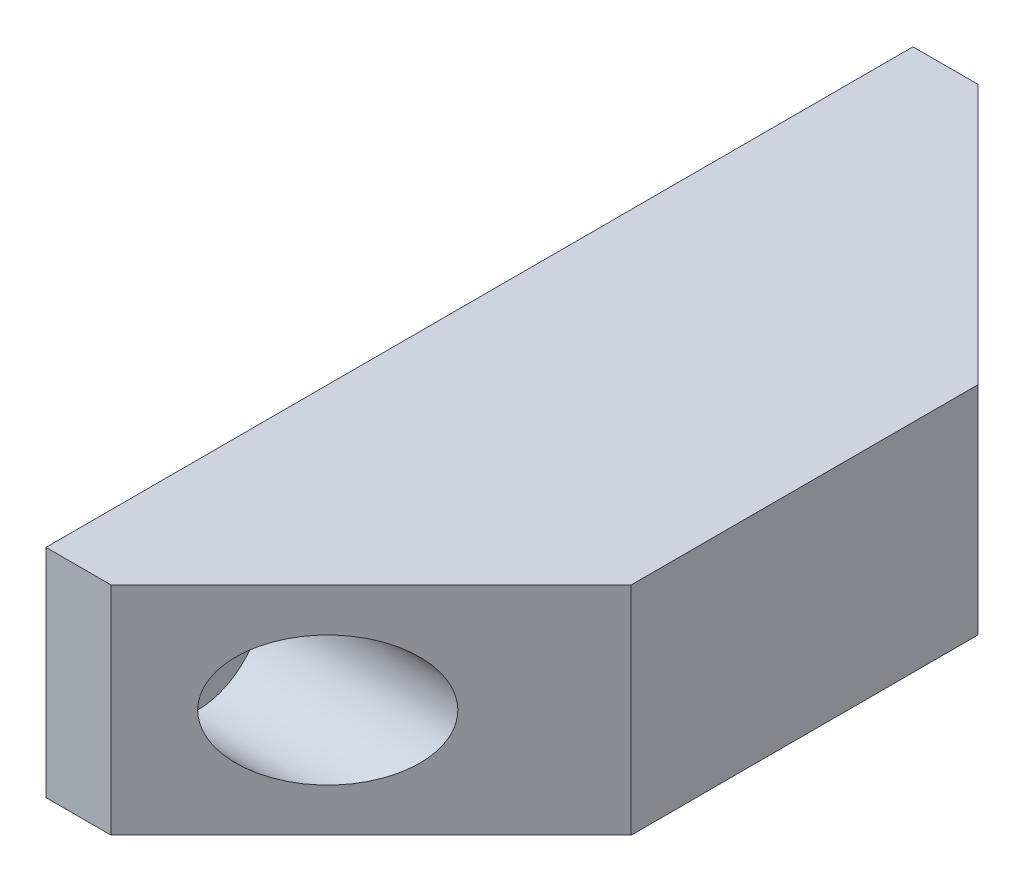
from build123d import *

# Parameters (mm, degrees)
BOSS_EXTRU_1_DEPTH = 5


with BuildPart() as part:
    # Esquisse1 → Boss.-Extru.1 (new, symmetric)
    with BuildSketch(Plane(origin=(0, 0, 0), x_dir=(1, 0, 0), z_dir=(0, 1, 0))):
        Polygon((0, 20), (3, 20), (15, 8), (15, -8), (3, -20), (0, -20), align=None)
    extrude(amount=BOSS_EXTRU_1_DEPTH, both=True)

    # Esquisse2 → Enl_vement de mati_re-R_volution1 (revolve, cut)
    with BuildSketch(Plane(origin=(0, 0, 0), x_dir=(1, 0, 0), z_dir=(0, 1, 0))):
        Polygon((0, 15), (0, 13.45), (2, 13.45), (2, 12), (15, 12), (15, 15), align=None)
    enl_vement_de_mati_re_r_volution1 = revolve(axis=Axis((-9.209238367, 0, -15), (1, 0, 0)), mode=Mode.SUBTRACT)

    # Sym_trie1: Enl_vement de mati_re-R_volution1 across plane
    add(enl_vement_de_mati_re_r_volution1.mirror(Plane.XY), mode=Mode.SUBTRACT)


solid = part.part
